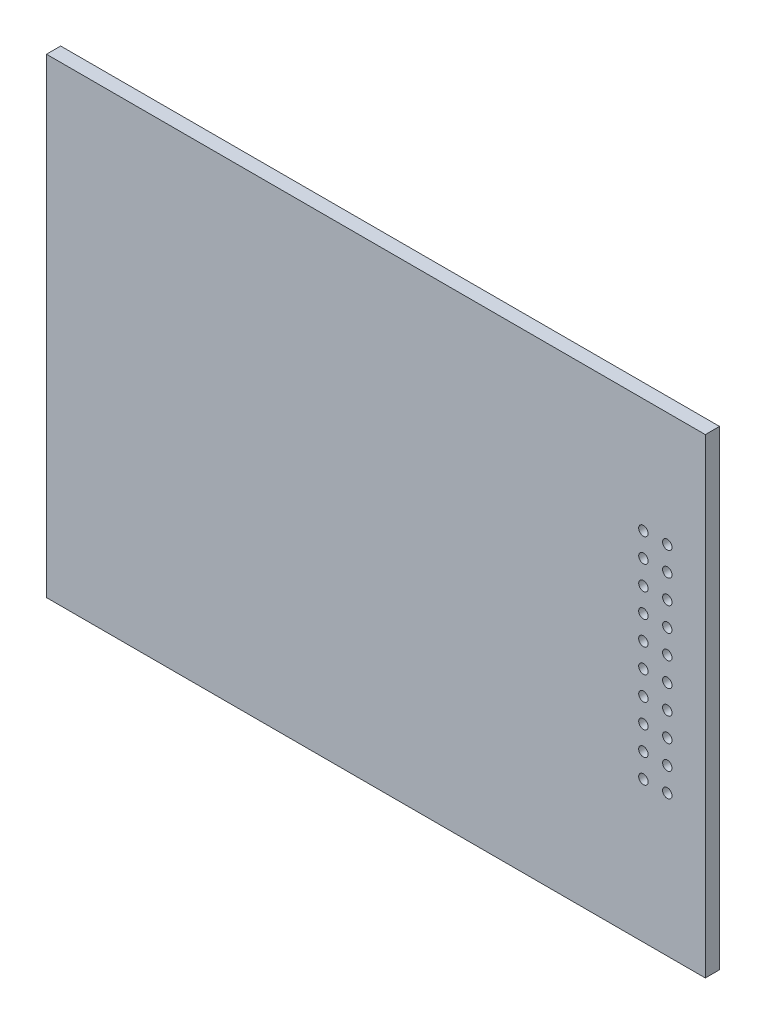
ISO-10303-21;
HEADER;
FILE_DESCRIPTION(('STEP AP214'),'2;1');
FILE_NAME('part.step','',(''),(''),'','','');
FILE_SCHEMA(('AUTOMOTIVE_DESIGN { 1 0 10303 214 1 1 1 1 }'));
ENDSEC;
DATA;
#1=APPLICATION_CONTEXT('core data for automotive mechanical design processes');
#2=APPLICATION_PROTOCOL_DEFINITION('international standard','automotive_design',2000,#1);
#3=PRODUCT_CONTEXT('',#1,'mechanical');
#4=PRODUCT('Part','Part','',(#3));
#5=PRODUCT_RELATED_PRODUCT_CATEGORY('part','',(#4));
#6=PRODUCT_DEFINITION_FORMATION('','',#4);
#7=PRODUCT_DEFINITION_CONTEXT('part definition',#1,'design');
#8=PRODUCT_DEFINITION('design','',#6,#7);
#9=PRODUCT_DEFINITION_SHAPE('','',#8);
#10=(LENGTH_UNIT() NAMED_UNIT(*) SI_UNIT(.MILLI.,.METRE.));
#11=(NAMED_UNIT(*) PLANE_ANGLE_UNIT() SI_UNIT($,.RADIAN.));
#12=(NAMED_UNIT(*) SI_UNIT($,.STERADIAN.) SOLID_ANGLE_UNIT());
#13=UNCERTAINTY_MEASURE_WITH_UNIT(LENGTH_MEASURE(1.E-05),#10,'distance_accuracy_value','');
#14=(GEOMETRIC_REPRESENTATION_CONTEXT(3) GLOBAL_UNCERTAINTY_ASSIGNED_CONTEXT((#13)) GLOBAL_UNIT_ASSIGNED_CONTEXT((#10,
#11,#12)) REPRESENTATION_CONTEXT('',''));
#15=CARTESIAN_POINT('',(0.,0.,0.));
#16=DIRECTION('',(0.,0.,1.));
#17=DIRECTION('',(1.,0.,0.));
#18=AXIS2_PLACEMENT_3D('',#15,#16,#17);
#19=CARTESIAN_POINT('',(85.96,-32.14,-0.046));
#20=DIRECTION('',(0.,0.,-1.));
#21=DIRECTION('',(0.,-1.,0.));
#22=AXIS2_PLACEMENT_3D('',#19,#20,#21);
#23=CYLINDRICAL_SURFACE('',#22,0.5);
#24=CARTESIAN_POINT('',(85.96,-32.14,0.));
#25=DIRECTION('',(0.,0.,-1.));
#26=DIRECTION('',(0.,-1.,0.));
#27=AXIS2_PLACEMENT_3D('',#24,#25,#26);
#28=CIRCLE('',#27,0.5);
#29=CARTESIAN_POINT('',(85.96,-32.64,0.));
#30=VERTEX_POINT('',#29);
#31=EDGE_CURVE('E395',#30,#30,#28,.T.);
#32=ORIENTED_EDGE('',*,*,#31,.T.);
#33=DIRECTION('',(0.,0.,1.));
#34=VECTOR('',#33,1.);
#35=CARTESIAN_POINT('',(85.96,-32.64,-0.046));
#36=LINE('',#35,#34);
#37=CARTESIAN_POINT('',(85.96,-32.64,1.51));
#38=VERTEX_POINT('',#37);
#39=EDGE_CURVE('E11',#30,#38,#36,.T.);
#40=ORIENTED_EDGE('',*,*,#39,.T.);
#41=CARTESIAN_POINT('',(85.96,-32.14,1.51));
#42=DIRECTION('',(0.,0.,-1.));
#43=DIRECTION('',(0.,-1.,0.));
#44=AXIS2_PLACEMENT_3D('',#41,#42,#43);
#45=CIRCLE('',#44,0.5);
#46=EDGE_CURVE('E345',#38,#38,#45,.T.);
#47=ORIENTED_EDGE('',*,*,#46,.F.);
#48=ORIENTED_EDGE('',*,*,#39,.F.);
#49=EDGE_LOOP('',(#32,#40,#47,#48));
#50=FACE_BOUND('',#49,.T.);
#51=ADVANCED_FACE('F17',(#50),#23,.F.);
#52=CARTESIAN_POINT('',(85.96,-34.68,-0.046));
#53=DIRECTION('',(0.,0.,-1.));
#54=DIRECTION('',(0.,-1.,0.));
#55=AXIS2_PLACEMENT_3D('',#52,#53,#54);
#56=CYLINDRICAL_SURFACE('',#55,0.5);
#57=CARTESIAN_POINT('',(85.96,-34.68,0.));
#58=DIRECTION('',(0.,0.,-1.));
#59=DIRECTION('',(0.,-1.,0.));
#60=AXIS2_PLACEMENT_3D('',#57,#58,#59);
#61=CIRCLE('',#60,0.5);
#62=CARTESIAN_POINT('',(85.96,-35.18,0.));
#63=VERTEX_POINT('',#62);
#64=EDGE_CURVE('E392',#63,#63,#61,.T.);
#65=ORIENTED_EDGE('',*,*,#64,.T.);
#66=DIRECTION('',(0.,0.,1.));
#67=VECTOR('',#66,1.);
#68=CARTESIAN_POINT('',(85.96,-35.18,-0.046));
#69=LINE('',#68,#67);
#70=CARTESIAN_POINT('',(85.96,-35.18,1.51));
#71=VERTEX_POINT('',#70);
#72=EDGE_CURVE('E20',#63,#71,#69,.T.);
#73=ORIENTED_EDGE('',*,*,#72,.T.);
#74=CARTESIAN_POINT('',(85.96,-34.68,1.51));
#75=DIRECTION('',(0.,0.,-1.));
#76=DIRECTION('',(0.,-1.,0.));
#77=AXIS2_PLACEMENT_3D('',#74,#75,#76);
#78=CIRCLE('',#77,0.5);
#79=EDGE_CURVE('E342',#71,#71,#78,.T.);
#80=ORIENTED_EDGE('',*,*,#79,.F.);
#81=ORIENTED_EDGE('',*,*,#72,.F.);
#82=EDGE_LOOP('',(#65,#73,#80,#81));
#83=FACE_BOUND('',#82,.T.);
#84=ADVANCED_FACE('F560',(#83),#56,.F.);
#85=CARTESIAN_POINT('',(85.96,-37.22,-0.046));
#86=DIRECTION('',(0.,0.,-1.));
#87=DIRECTION('',(0.,-1.,0.));
#88=AXIS2_PLACEMENT_3D('',#85,#86,#87);
#89=CYLINDRICAL_SURFACE('',#88,0.5);
#90=CARTESIAN_POINT('',(85.96,-37.22,0.));
#91=DIRECTION('',(0.,0.,-1.));
#92=DIRECTION('',(0.,-1.,0.));
#93=AXIS2_PLACEMENT_3D('',#90,#91,#92);
#94=CIRCLE('',#93,0.5);
#95=CARTESIAN_POINT('',(85.96,-37.72,0.));
#96=VERTEX_POINT('',#95);
#97=EDGE_CURVE('E385',#96,#96,#94,.T.);
#98=ORIENTED_EDGE('',*,*,#97,.T.);
#99=DIRECTION('',(0.,0.,1.));
#100=VECTOR('',#99,1.);
#101=CARTESIAN_POINT('',(85.96,-37.72,-0.046));
#102=LINE('',#101,#100);
#103=CARTESIAN_POINT('',(85.96,-37.72,1.51));
#104=VERTEX_POINT('',#103);
#105=EDGE_CURVE('E489',#96,#104,#102,.T.);
#106=ORIENTED_EDGE('',*,*,#105,.T.);
#107=CARTESIAN_POINT('',(85.96,-37.22,1.51));
#108=DIRECTION('',(0.,0.,-1.));
#109=DIRECTION('',(0.,-1.,0.));
#110=AXIS2_PLACEMENT_3D('',#107,#108,#109);
#111=CIRCLE('',#110,0.5);
#112=EDGE_CURVE('E346',#104,#104,#111,.T.);
#113=ORIENTED_EDGE('',*,*,#112,.F.);
#114=ORIENTED_EDGE('',*,*,#105,.F.);
#115=EDGE_LOOP('',(#98,#106,#113,#114));
#116=FACE_BOUND('',#115,.T.);
#117=ADVANCED_FACE('F564',(#116),#89,.F.);
#118=CARTESIAN_POINT('',(85.96,-39.76,-0.046));
#119=DIRECTION('',(0.,0.,-1.));
#120=DIRECTION('',(0.,-1.,0.));
#121=AXIS2_PLACEMENT_3D('',#118,#119,#120);
#122=CYLINDRICAL_SURFACE('',#121,0.5);
#123=CARTESIAN_POINT('',(85.96,-39.76,0.));
#124=DIRECTION('',(0.,0.,-1.));
#125=DIRECTION('',(0.,-1.,0.));
#126=AXIS2_PLACEMENT_3D('',#123,#124,#125);
#127=CIRCLE('',#126,0.5);
#128=CARTESIAN_POINT('',(85.96,-40.26,0.));
#129=VERTEX_POINT('',#128);
#130=EDGE_CURVE('E336',#129,#129,#127,.T.);
#131=ORIENTED_EDGE('',*,*,#130,.T.);
#132=DIRECTION('',(0.,0.,1.));
#133=VECTOR('',#132,1.);
#134=CARTESIAN_POINT('',(85.96,-40.26,-0.046));
#135=LINE('',#134,#133);
#136=CARTESIAN_POINT('',(85.96,-40.26,1.51));
#137=VERTEX_POINT('',#136);
#138=EDGE_CURVE('E492',#129,#137,#135,.T.);
#139=ORIENTED_EDGE('',*,*,#138,.T.);
#140=CARTESIAN_POINT('',(85.96,-39.76,1.51));
#141=DIRECTION('',(0.,0.,-1.));
#142=DIRECTION('',(0.,-1.,0.));
#143=AXIS2_PLACEMENT_3D('',#140,#141,#142);
#144=CIRCLE('',#143,0.5);
#145=EDGE_CURVE('E468',#137,#137,#144,.T.);
#146=ORIENTED_EDGE('',*,*,#145,.F.);
#147=ORIENTED_EDGE('',*,*,#138,.F.);
#148=EDGE_LOOP('',(#131,#139,#146,#147));
#149=FACE_BOUND('',#148,.T.);
#150=ADVANCED_FACE('F502',(#149),#122,.F.);
#151=CARTESIAN_POINT('',(85.96,-42.3,-0.046));
#152=DIRECTION('',(0.,0.,-1.));
#153=DIRECTION('',(0.,-1.,0.));
#154=AXIS2_PLACEMENT_3D('',#151,#152,#153);
#155=CYLINDRICAL_SURFACE('',#154,0.5);
#156=CARTESIAN_POINT('',(85.96,-42.3,0.));
#157=DIRECTION('',(0.,0.,-1.));
#158=DIRECTION('',(0.,-1.,0.));
#159=AXIS2_PLACEMENT_3D('',#156,#157,#158);
#160=CIRCLE('',#159,0.5);
#161=CARTESIAN_POINT('',(85.96,-42.8,0.));
#162=VERTEX_POINT('',#161);
#163=EDGE_CURVE('E332',#162,#162,#160,.T.);
#164=ORIENTED_EDGE('',*,*,#163,.T.);
#165=DIRECTION('',(0.,0.,1.));
#166=VECTOR('',#165,1.);
#167=CARTESIAN_POINT('',(85.96,-42.8,-0.046));
#168=LINE('',#167,#166);
#169=CARTESIAN_POINT('',(85.96,-42.8,1.51));
#170=VERTEX_POINT('',#169);
#171=EDGE_CURVE('E495',#162,#170,#168,.T.);
#172=ORIENTED_EDGE('',*,*,#171,.T.);
#173=CARTESIAN_POINT('',(85.96,-42.3,1.51));
#174=DIRECTION('',(0.,0.,-1.));
#175=DIRECTION('',(0.,-1.,0.));
#176=AXIS2_PLACEMENT_3D('',#173,#174,#175);
#177=CIRCLE('',#176,0.5);
#178=EDGE_CURVE('E464',#170,#170,#177,.T.);
#179=ORIENTED_EDGE('',*,*,#178,.F.);
#180=ORIENTED_EDGE('',*,*,#171,.F.);
#181=EDGE_LOOP('',(#164,#172,#179,#180));
#182=FACE_BOUND('',#181,.T.);
#183=ADVANCED_FACE('F659',(#182),#155,.F.);
#184=CARTESIAN_POINT('',(83.42,-32.14,-0.046));
#185=DIRECTION('',(0.,0.,-1.));
#186=DIRECTION('',(0.,-1.,0.));
#187=AXIS2_PLACEMENT_3D('',#184,#185,#186);
#188=CYLINDRICAL_SURFACE('',#187,0.5);
#189=CARTESIAN_POINT('',(83.42,-32.14,0.));
#190=DIRECTION('',(0.,0.,-1.));
#191=DIRECTION('',(0.,-1.,0.));
#192=AXIS2_PLACEMENT_3D('',#189,#190,#191);
#193=CIRCLE('',#192,0.5);
#194=CARTESIAN_POINT('',(83.42,-32.64,0.));
#195=VERTEX_POINT('',#194);
#196=EDGE_CURVE('E337',#195,#195,#193,.T.);
#197=ORIENTED_EDGE('',*,*,#196,.T.);
#198=DIRECTION('',(0.,0.,1.));
#199=VECTOR('',#198,1.);
#200=CARTESIAN_POINT('',(83.42,-32.64,-0.046));
#201=LINE('',#200,#199);
#202=CARTESIAN_POINT('',(83.42,-32.64,1.51));
#203=VERTEX_POINT('',#202);
#204=EDGE_CURVE('E331',#195,#203,#201,.T.);
#205=ORIENTED_EDGE('',*,*,#204,.T.);
#206=CARTESIAN_POINT('',(83.42,-32.14,1.51));
#207=DIRECTION('',(0.,0.,-1.));
#208=DIRECTION('',(0.,-1.,0.));
#209=AXIS2_PLACEMENT_3D('',#206,#207,#208);
#210=CIRCLE('',#209,0.5);
#211=EDGE_CURVE('E458',#203,#203,#210,.T.);
#212=ORIENTED_EDGE('',*,*,#211,.F.);
#213=ORIENTED_EDGE('',*,*,#204,.F.);
#214=EDGE_LOOP('',(#197,#205,#212,#213));
#215=FACE_BOUND('',#214,.T.);
#216=ADVANCED_FACE('F655',(#215),#188,.F.);
#217=CARTESIAN_POINT('',(83.42,-34.68,-0.046));
#218=DIRECTION('',(0.,0.,-1.));
#219=DIRECTION('',(0.,-1.,0.));
#220=AXIS2_PLACEMENT_3D('',#217,#218,#219);
#221=CYLINDRICAL_SURFACE('',#220,0.5);
#222=CARTESIAN_POINT('',(83.42,-34.68,0.));
#223=DIRECTION('',(0.,0.,-1.));
#224=DIRECTION('',(0.,-1.,0.));
#225=AXIS2_PLACEMENT_3D('',#222,#223,#224);
#226=CIRCLE('',#225,0.5);
#227=CARTESIAN_POINT('',(83.42,-35.18,0.));
#228=VERTEX_POINT('',#227);
#229=EDGE_CURVE('E375',#228,#228,#226,.T.);
#230=ORIENTED_EDGE('',*,*,#229,.T.);
#231=DIRECTION('',(0.,0.,1.));
#232=VECTOR('',#231,1.);
#233=CARTESIAN_POINT('',(83.42,-35.18,-0.046));
#234=LINE('',#233,#232);
#235=CARTESIAN_POINT('',(83.42,-35.18,1.51));
#236=VERTEX_POINT('',#235);
#237=EDGE_CURVE('E328',#228,#236,#234,.T.);
#238=ORIENTED_EDGE('',*,*,#237,.T.);
#239=CARTESIAN_POINT('',(83.42,-34.68,1.51));
#240=DIRECTION('',(0.,0.,-1.));
#241=DIRECTION('',(0.,-1.,0.));
#242=AXIS2_PLACEMENT_3D('',#239,#240,#241);
#243=CIRCLE('',#242,0.5);
#244=EDGE_CURVE('E454',#236,#236,#243,.T.);
#245=ORIENTED_EDGE('',*,*,#244,.F.);
#246=ORIENTED_EDGE('',*,*,#237,.F.);
#247=EDGE_LOOP('',(#230,#238,#245,#246));
#248=FACE_BOUND('',#247,.T.);
#249=ADVANCED_FACE('F651',(#248),#221,.F.);
#250=CARTESIAN_POINT('',(83.42,-37.22,-0.046));
#251=DIRECTION('',(0.,0.,-1.));
#252=DIRECTION('',(0.,-1.,0.));
#253=AXIS2_PLACEMENT_3D('',#250,#251,#252);
#254=CYLINDRICAL_SURFACE('',#253,0.5);
#255=CARTESIAN_POINT('',(83.42,-37.22,0.));
#256=DIRECTION('',(0.,0.,-1.));
#257=DIRECTION('',(0.,-1.,0.));
#258=AXIS2_PLACEMENT_3D('',#255,#256,#257);
#259=CIRCLE('',#258,0.5);
#260=CARTESIAN_POINT('',(83.42,-37.72,0.));
#261=VERTEX_POINT('',#260);
#262=EDGE_CURVE('E371',#261,#261,#259,.T.);
#263=ORIENTED_EDGE('',*,*,#262,.T.);
#264=DIRECTION('',(0.,0.,1.));
#265=VECTOR('',#264,1.);
#266=CARTESIAN_POINT('',(83.42,-37.72,-0.046));
#267=LINE('',#266,#265);
#268=CARTESIAN_POINT('',(83.42,-37.72,1.51));
#269=VERTEX_POINT('',#268);
#270=EDGE_CURVE('E287',#261,#269,#267,.T.);
#271=ORIENTED_EDGE('',*,*,#270,.T.);
#272=CARTESIAN_POINT('',(83.42,-37.22,1.51));
#273=DIRECTION('',(0.,0.,-1.));
#274=DIRECTION('',(0.,-1.,0.));
#275=AXIS2_PLACEMENT_3D('',#272,#273,#274);
#276=CIRCLE('',#275,0.5);
#277=EDGE_CURVE('E450',#269,#269,#276,.T.);
#278=ORIENTED_EDGE('',*,*,#277,.F.);
#279=ORIENTED_EDGE('',*,*,#270,.F.);
#280=EDGE_LOOP('',(#263,#271,#278,#279));
#281=FACE_BOUND('',#280,.T.);
#282=ADVANCED_FACE('F633',(#281),#254,.F.);
#283=CARTESIAN_POINT('',(83.42,-39.76,-0.046));
#284=DIRECTION('',(0.,0.,-1.));
#285=DIRECTION('',(0.,-1.,0.));
#286=AXIS2_PLACEMENT_3D('',#283,#284,#285);
#287=CYLINDRICAL_SURFACE('',#286,0.5);
#288=CARTESIAN_POINT('',(83.42,-39.76,0.));
#289=DIRECTION('',(0.,0.,-1.));
#290=DIRECTION('',(0.,-1.,0.));
#291=AXIS2_PLACEMENT_3D('',#288,#289,#290);
#292=CIRCLE('',#291,0.5);
#293=CARTESIAN_POINT('',(83.42,-40.26,0.));
#294=VERTEX_POINT('',#293);
#295=EDGE_CURVE('E364',#294,#294,#292,.T.);
#296=ORIENTED_EDGE('',*,*,#295,.T.);
#297=DIRECTION('',(0.,0.,1.));
#298=VECTOR('',#297,1.);
#299=CARTESIAN_POINT('',(83.42,-40.26,-0.046));
#300=LINE('',#299,#298);
#301=CARTESIAN_POINT('',(83.42,-40.26,1.51));
#302=VERTEX_POINT('',#301);
#303=EDGE_CURVE('E284',#294,#302,#300,.T.);
#304=ORIENTED_EDGE('',*,*,#303,.T.);
#305=CARTESIAN_POINT('',(83.42,-39.76,1.51));
#306=DIRECTION('',(0.,0.,-1.));
#307=DIRECTION('',(0.,-1.,0.));
#308=AXIS2_PLACEMENT_3D('',#305,#306,#307);
#309=CIRCLE('',#308,0.5);
#310=EDGE_CURVE('E446',#302,#302,#309,.T.);
#311=ORIENTED_EDGE('',*,*,#310,.F.);
#312=ORIENTED_EDGE('',*,*,#303,.F.);
#313=EDGE_LOOP('',(#296,#304,#311,#312));
#314=FACE_BOUND('',#313,.T.);
#315=ADVANCED_FACE('F629',(#314),#287,.F.);
#316=CARTESIAN_POINT('',(83.42,-42.3,-0.046));
#317=DIRECTION('',(0.,0.,-1.));
#318=DIRECTION('',(0.,-1.,0.));
#319=AXIS2_PLACEMENT_3D('',#316,#317,#318);
#320=CYLINDRICAL_SURFACE('',#319,0.5);
#321=CARTESIAN_POINT('',(83.42,-42.3,0.));
#322=DIRECTION('',(0.,0.,-1.));
#323=DIRECTION('',(0.,-1.,0.));
#324=AXIS2_PLACEMENT_3D('',#321,#322,#323);
#325=CIRCLE('',#324,0.5);
#326=CARTESIAN_POINT('',(83.42,-42.8,0.));
#327=VERTEX_POINT('',#326);
#328=EDGE_CURVE('E360',#327,#327,#325,.T.);
#329=ORIENTED_EDGE('',*,*,#328,.T.);
#330=DIRECTION('',(0.,0.,1.));
#331=VECTOR('',#330,1.);
#332=CARTESIAN_POINT('',(83.42,-42.8,-0.046));
#333=LINE('',#332,#331);
#334=CARTESIAN_POINT('',(83.42,-42.8,1.51));
#335=VERTEX_POINT('',#334);
#336=EDGE_CURVE('E288',#327,#335,#333,.T.);
#337=ORIENTED_EDGE('',*,*,#336,.T.);
#338=CARTESIAN_POINT('',(83.42,-42.3,1.51));
#339=DIRECTION('',(0.,0.,-1.));
#340=DIRECTION('',(0.,-1.,0.));
#341=AXIS2_PLACEMENT_3D('',#338,#339,#340);
#342=CIRCLE('',#341,0.5);
#343=EDGE_CURVE('E442',#335,#335,#342,.T.);
#344=ORIENTED_EDGE('',*,*,#343,.F.);
#345=ORIENTED_EDGE('',*,*,#336,.F.);
#346=EDGE_LOOP('',(#329,#337,#344,#345));
#347=FACE_BOUND('',#346,.T.);
#348=ADVANCED_FACE('F632',(#347),#320,.F.);
#349=CARTESIAN_POINT('',(85.96,-44.84,-0.046));
#350=DIRECTION('',(0.,0.,-1.));
#351=DIRECTION('',(0.,-1.,0.));
#352=AXIS2_PLACEMENT_3D('',#349,#350,#351);
#353=CYLINDRICAL_SURFACE('',#352,0.5);
#354=CARTESIAN_POINT('',(85.96,-44.84,0.));
#355=DIRECTION('',(0.,0.,-1.));
#356=DIRECTION('',(0.,-1.,0.));
#357=AXIS2_PLACEMENT_3D('',#354,#355,#356);
#358=CIRCLE('',#357,0.5);
#359=CARTESIAN_POINT('',(85.96,-45.34,0.));
#360=VERTEX_POINT('',#359);
#361=EDGE_CURVE('E354',#360,#360,#358,.T.);
#362=ORIENTED_EDGE('',*,*,#361,.T.);
#363=DIRECTION('',(0.,0.,1.));
#364=VECTOR('',#363,1.);
#365=CARTESIAN_POINT('',(85.96,-45.34,-0.046));
#366=LINE('',#365,#364);
#367=CARTESIAN_POINT('',(85.96,-45.34,1.51));
#368=VERTEX_POINT('',#367);
#369=EDGE_CURVE('E388',#360,#368,#366,.T.);
#370=ORIENTED_EDGE('',*,*,#369,.T.);
#371=CARTESIAN_POINT('',(85.96,-44.84,1.51));
#372=DIRECTION('',(0.,0.,-1.));
#373=DIRECTION('',(0.,-1.,0.));
#374=AXIS2_PLACEMENT_3D('',#371,#372,#373);
#375=CIRCLE('',#374,0.5);
#376=EDGE_CURVE('E438',#368,#368,#375,.T.);
#377=ORIENTED_EDGE('',*,*,#376,.F.);
#378=ORIENTED_EDGE('',*,*,#369,.F.);
#379=EDGE_LOOP('',(#362,#370,#377,#378));
#380=FACE_BOUND('',#379,.T.);
#381=ADVANCED_FACE('F644',(#380),#353,.F.);
#382=CARTESIAN_POINT('',(85.96,-47.38,-0.046));
#383=DIRECTION('',(0.,0.,-1.));
#384=DIRECTION('',(0.,-1.,0.));
#385=AXIS2_PLACEMENT_3D('',#382,#383,#384);
#386=CYLINDRICAL_SURFACE('',#385,0.5);
#387=CARTESIAN_POINT('',(85.96,-47.38,0.));
#388=DIRECTION('',(0.,0.,-1.));
#389=DIRECTION('',(0.,-1.,0.));
#390=AXIS2_PLACEMENT_3D('',#387,#388,#389);
#391=CIRCLE('',#390,0.5);
#392=CARTESIAN_POINT('',(85.96,-47.88,0.));
#393=VERTEX_POINT('',#392);
#394=EDGE_CURVE('E350',#393,#393,#391,.T.);
#395=ORIENTED_EDGE('',*,*,#394,.T.);
#396=DIRECTION('',(0.,0.,1.));
#397=VECTOR('',#396,1.);
#398=CARTESIAN_POINT('',(85.96,-47.88,-0.046));
#399=LINE('',#398,#397);
#400=CARTESIAN_POINT('',(85.96,-47.88,1.51));
#401=VERTEX_POINT('',#400);
#402=EDGE_CURVE('E412',#393,#401,#399,.T.);
#403=ORIENTED_EDGE('',*,*,#402,.T.);
#404=CARTESIAN_POINT('',(85.96,-47.38,1.51));
#405=DIRECTION('',(0.,0.,-1.));
#406=DIRECTION('',(0.,-1.,0.));
#407=AXIS2_PLACEMENT_3D('',#404,#405,#406);
#408=CIRCLE('',#407,0.5);
#409=EDGE_CURVE('E434',#401,#401,#408,.T.);
#410=ORIENTED_EDGE('',*,*,#409,.F.);
#411=ORIENTED_EDGE('',*,*,#402,.F.);
#412=EDGE_LOOP('',(#395,#403,#410,#411));
#413=FACE_BOUND('',#412,.T.);
#414=ADVANCED_FACE('F640',(#413),#386,.F.);
#415=CARTESIAN_POINT('',(85.96,-49.92,-0.046));
#416=DIRECTION('',(0.,0.,-1.));
#417=DIRECTION('',(0.,-1.,0.));
#418=AXIS2_PLACEMENT_3D('',#415,#416,#417);
#419=CYLINDRICAL_SURFACE('',#418,0.5);
#420=CARTESIAN_POINT('',(85.96,-49.92,0.));
#421=DIRECTION('',(0.,0.,-1.));
#422=DIRECTION('',(0.,-1.,0.));
#423=AXIS2_PLACEMENT_3D('',#420,#421,#422);
#424=CIRCLE('',#423,0.5);
#425=CARTESIAN_POINT('',(85.96,-50.42,0.));
#426=VERTEX_POINT('',#425);
#427=EDGE_CURVE('E341',#426,#426,#424,.T.);
#428=ORIENTED_EDGE('',*,*,#427,.T.);
#429=DIRECTION('',(0.,0.,1.));
#430=VECTOR('',#429,1.);
#431=CARTESIAN_POINT('',(85.96,-50.42,-0.046));
#432=LINE('',#431,#430);
#433=CARTESIAN_POINT('',(85.96,-50.42,1.51));
#434=VERTEX_POINT('',#433);
#435=EDGE_CURVE('E409',#426,#434,#432,.T.);
#436=ORIENTED_EDGE('',*,*,#435,.T.);
#437=CARTESIAN_POINT('',(85.96,-49.92,1.51));
#438=DIRECTION('',(0.,0.,-1.));
#439=DIRECTION('',(0.,-1.,0.));
#440=AXIS2_PLACEMENT_3D('',#437,#438,#439);
#441=CIRCLE('',#440,0.5);
#442=EDGE_CURVE('E430',#434,#434,#441,.T.);
#443=ORIENTED_EDGE('',*,*,#442,.F.);
#444=ORIENTED_EDGE('',*,*,#435,.F.);
#445=EDGE_LOOP('',(#428,#436,#443,#444));
#446=FACE_BOUND('',#445,.T.);
#447=ADVANCED_FACE('F627',(#446),#419,.F.);
#448=CARTESIAN_POINT('',(85.96,-52.46,-0.046));
#449=DIRECTION('',(0.,0.,-1.));
#450=DIRECTION('',(0.,-1.,0.));
#451=AXIS2_PLACEMENT_3D('',#448,#449,#450);
#452=CYLINDRICAL_SURFACE('',#451,0.5);
#453=CARTESIAN_POINT('',(85.96,-52.46,0.));
#454=DIRECTION('',(0.,0.,-1.));
#455=DIRECTION('',(0.,-1.,0.));
#456=AXIS2_PLACEMENT_3D('',#453,#454,#455);
#457=CIRCLE('',#456,0.5);
#458=CARTESIAN_POINT('',(85.96,-52.96,0.));
#459=VERTEX_POINT('',#458);
#460=EDGE_CURVE('E327',#459,#459,#457,.T.);
#461=ORIENTED_EDGE('',*,*,#460,.T.);
#462=DIRECTION('',(0.,0.,1.));
#463=VECTOR('',#462,1.);
#464=CARTESIAN_POINT('',(85.96,-52.96,-0.046));
#465=LINE('',#464,#463);
#466=CARTESIAN_POINT('',(85.96,-52.96,1.51));
#467=VERTEX_POINT('',#466);
#468=EDGE_CURVE('E358',#459,#467,#465,.T.);
#469=ORIENTED_EDGE('',*,*,#468,.T.);
#470=CARTESIAN_POINT('',(85.96,-52.46,1.51));
#471=DIRECTION('',(0.,0.,-1.));
#472=DIRECTION('',(0.,-1.,0.));
#473=AXIS2_PLACEMENT_3D('',#470,#471,#472);
#474=CIRCLE('',#473,0.5);
#475=EDGE_CURVE('E420',#467,#467,#474,.T.);
#476=ORIENTED_EDGE('',*,*,#475,.F.);
#477=ORIENTED_EDGE('',*,*,#468,.F.);
#478=EDGE_LOOP('',(#461,#469,#476,#477));
#479=FACE_BOUND('',#478,.T.);
#480=ADVANCED_FACE('F623',(#479),#452,.F.);
#481=CARTESIAN_POINT('',(85.96,-55.,-0.046));
#482=DIRECTION('',(0.,0.,-1.));
#483=DIRECTION('',(0.,-1.,0.));
#484=AXIS2_PLACEMENT_3D('',#481,#482,#483);
#485=CYLINDRICAL_SURFACE('',#484,0.5);
#486=CARTESIAN_POINT('',(85.96,-55.,0.));
#487=DIRECTION('',(0.,0.,-1.));
#488=DIRECTION('',(0.,-1.,0.));
#489=AXIS2_PLACEMENT_3D('',#486,#487,#488);
#490=CIRCLE('',#489,0.5);
#491=CARTESIAN_POINT('',(85.96,-55.5,0.));
#492=VERTEX_POINT('',#491);
#493=EDGE_CURVE('E323',#492,#492,#490,.T.);
#494=ORIENTED_EDGE('',*,*,#493,.T.);
#495=DIRECTION('',(0.,0.,1.));
#496=VECTOR('',#495,1.);
#497=CARTESIAN_POINT('',(85.96,-55.5,-0.046));
#498=LINE('',#497,#496);
#499=CARTESIAN_POINT('',(85.96,-55.5,1.51));
#500=VERTEX_POINT('',#499);
#501=EDGE_CURVE('E355',#492,#500,#498,.T.);
#502=ORIENTED_EDGE('',*,*,#501,.T.);
#503=CARTESIAN_POINT('',(85.96,-55.,1.51));
#504=DIRECTION('',(0.,0.,-1.));
#505=DIRECTION('',(0.,-1.,0.));
#506=AXIS2_PLACEMENT_3D('',#503,#504,#505);
#507=CIRCLE('',#506,0.5);
#508=EDGE_CURVE('E280',#500,#500,#507,.T.);
#509=ORIENTED_EDGE('',*,*,#508,.F.);
#510=ORIENTED_EDGE('',*,*,#501,.F.);
#511=EDGE_LOOP('',(#494,#502,#509,#510));
#512=FACE_BOUND('',#511,.T.);
#513=ADVANCED_FACE('F620',(#512),#485,.F.);
#514=CARTESIAN_POINT('',(83.42,-44.84,-0.046));
#515=DIRECTION('',(0.,0.,-1.));
#516=DIRECTION('',(0.,-1.,0.));
#517=AXIS2_PLACEMENT_3D('',#514,#515,#516);
#518=CYLINDRICAL_SURFACE('',#517,0.5);
#519=CARTESIAN_POINT('',(83.42,-44.84,0.));
#520=DIRECTION('',(0.,0.,-1.));
#521=DIRECTION('',(0.,-1.,0.));
#522=AXIS2_PLACEMENT_3D('',#519,#520,#521);
#523=CIRCLE('',#522,0.5);
#524=CARTESIAN_POINT('',(83.42,-45.34,0.));
#525=VERTEX_POINT('',#524);
#526=EDGE_CURVE('E319',#525,#525,#523,.T.);
#527=ORIENTED_EDGE('',*,*,#526,.T.);
#528=DIRECTION('',(0.,0.,1.));
#529=VECTOR('',#528,1.);
#530=CARTESIAN_POINT('',(83.42,-45.34,-0.046));
#531=LINE('',#530,#529);
#532=CARTESIAN_POINT('',(83.42,-45.34,1.51));
#533=VERTEX_POINT('',#532);
#534=EDGE_CURVE('E359',#525,#533,#531,.T.);
#535=ORIENTED_EDGE('',*,*,#534,.T.);
#536=CARTESIAN_POINT('',(83.42,-44.84,1.51));
#537=DIRECTION('',(0.,0.,-1.));
#538=DIRECTION('',(0.,-1.,0.));
#539=AXIS2_PLACEMENT_3D('',#536,#537,#538);
#540=CIRCLE('',#539,0.5);
#541=EDGE_CURVE('E276',#533,#533,#540,.T.);
#542=ORIENTED_EDGE('',*,*,#541,.F.);
#543=ORIENTED_EDGE('',*,*,#534,.F.);
#544=EDGE_LOOP('',(#527,#535,#542,#543));
#545=FACE_BOUND('',#544,.T.);
#546=ADVANCED_FACE('F618',(#545),#518,.F.);
#547=CARTESIAN_POINT('',(83.42,-47.38,-0.046));
#548=DIRECTION('',(0.,0.,-1.));
#549=DIRECTION('',(0.,-1.,0.));
#550=AXIS2_PLACEMENT_3D('',#547,#548,#549);
#551=CYLINDRICAL_SURFACE('',#550,0.5);
#552=CARTESIAN_POINT('',(83.42,-47.38,0.));
#553=DIRECTION('',(0.,0.,-1.));
#554=DIRECTION('',(0.,-1.,0.));
#555=AXIS2_PLACEMENT_3D('',#552,#553,#554);
#556=CIRCLE('',#555,0.5);
#557=CARTESIAN_POINT('',(83.42,-47.88,0.));
#558=VERTEX_POINT('',#557);
#559=EDGE_CURVE('E312',#558,#558,#556,.T.);
#560=ORIENTED_EDGE('',*,*,#559,.T.);
#561=DIRECTION('',(0.,0.,1.));
#562=VECTOR('',#561,1.);
#563=CARTESIAN_POINT('',(83.42,-47.88,-0.046));
#564=LINE('',#563,#562);
#565=CARTESIAN_POINT('',(83.42,-47.88,1.51));
#566=VERTEX_POINT('',#565);
#567=EDGE_CURVE('E273',#558,#566,#564,.T.);
#568=ORIENTED_EDGE('',*,*,#567,.T.);
#569=CARTESIAN_POINT('',(83.42,-47.38,1.51));
#570=DIRECTION('',(0.,0.,-1.));
#571=DIRECTION('',(0.,-1.,0.));
#572=AXIS2_PLACEMENT_3D('',#569,#570,#571);
#573=CIRCLE('',#572,0.5);
#574=EDGE_CURVE('E281',#566,#566,#573,.T.);
#575=ORIENTED_EDGE('',*,*,#574,.F.);
#576=ORIENTED_EDGE('',*,*,#567,.F.);
#577=EDGE_LOOP('',(#560,#568,#575,#576));
#578=FACE_BOUND('',#577,.T.);
#579=ADVANCED_FACE('F612',(#578),#551,.F.);
#580=CARTESIAN_POINT('',(83.42,-49.92,-0.046));
#581=DIRECTION('',(0.,0.,-1.));
#582=DIRECTION('',(0.,-1.,0.));
#583=AXIS2_PLACEMENT_3D('',#580,#581,#582);
#584=CYLINDRICAL_SURFACE('',#583,0.5);
#585=CARTESIAN_POINT('',(83.42,-49.92,0.));
#586=DIRECTION('',(0.,0.,-1.));
#587=DIRECTION('',(0.,-1.,0.));
#588=AXIS2_PLACEMENT_3D('',#585,#586,#587);
#589=CIRCLE('',#588,0.5);
#590=CARTESIAN_POINT('',(83.42,-50.42,0.));
#591=VERTEX_POINT('',#590);
#592=EDGE_CURVE('E308',#591,#591,#589,.T.);
#593=ORIENTED_EDGE('',*,*,#592,.T.);
#594=DIRECTION('',(0.,0.,1.));
#595=VECTOR('',#594,1.);
#596=CARTESIAN_POINT('',(83.42,-50.42,-0.046));
#597=LINE('',#596,#595);
#598=CARTESIAN_POINT('',(83.42,-50.42,1.51));
#599=VERTEX_POINT('',#598);
#600=EDGE_CURVE('E271',#591,#599,#597,.T.);
#601=ORIENTED_EDGE('',*,*,#600,.T.);
#602=CARTESIAN_POINT('',(83.42,-49.92,1.51));
#603=DIRECTION('',(0.,0.,-1.));
#604=DIRECTION('',(0.,-1.,0.));
#605=AXIS2_PLACEMENT_3D('',#602,#603,#604);
#606=CIRCLE('',#605,0.5);
#607=EDGE_CURVE('E416',#599,#599,#606,.T.);
#608=ORIENTED_EDGE('',*,*,#607,.F.);
#609=ORIENTED_EDGE('',*,*,#600,.F.);
#610=EDGE_LOOP('',(#593,#601,#608,#609));
#611=FACE_BOUND('',#610,.T.);
#612=ADVANCED_FACE('F608',(#611),#584,.F.);
#613=CARTESIAN_POINT('',(83.42,-52.46,-0.046));
#614=DIRECTION('',(0.,0.,-1.));
#615=DIRECTION('',(0.,-1.,0.));
#616=AXIS2_PLACEMENT_3D('',#613,#614,#615);
#617=CYLINDRICAL_SURFACE('',#616,0.5);
#618=CARTESIAN_POINT('',(83.42,-52.46,0.));
#619=DIRECTION('',(0.,0.,-1.));
#620=DIRECTION('',(0.,-1.,0.));
#621=AXIS2_PLACEMENT_3D('',#618,#619,#620);
#622=CIRCLE('',#621,0.5);
#623=CARTESIAN_POINT('',(83.42,-52.96,0.));
#624=VERTEX_POINT('',#623);
#625=EDGE_CURVE('E302',#624,#624,#622,.T.);
#626=ORIENTED_EDGE('',*,*,#625,.T.);
#627=DIRECTION('',(0.,0.,1.));
#628=VECTOR('',#627,1.);
#629=CARTESIAN_POINT('',(83.42,-52.96,-0.046));
#630=LINE('',#629,#628);
#631=CARTESIAN_POINT('',(83.42,-52.96,1.51));
#632=VERTEX_POINT('',#631);
#633=EDGE_CURVE('E274',#624,#632,#630,.T.);
#634=ORIENTED_EDGE('',*,*,#633,.T.);
#635=CARTESIAN_POINT('',(83.42,-52.46,1.51));
#636=DIRECTION('',(0.,0.,-1.));
#637=DIRECTION('',(0.,-1.,0.));
#638=AXIS2_PLACEMENT_3D('',#635,#636,#637);
#639=CIRCLE('',#638,0.5);
#640=EDGE_CURVE('E407',#632,#632,#639,.T.);
#641=ORIENTED_EDGE('',*,*,#640,.F.);
#642=ORIENTED_EDGE('',*,*,#633,.F.);
#643=EDGE_LOOP('',(#626,#634,#641,#642));
#644=FACE_BOUND('',#643,.T.);
#645=ADVANCED_FACE('F554',(#644),#617,.F.);
#646=CARTESIAN_POINT('',(83.42,-55.,-0.046));
#647=DIRECTION('',(0.,0.,-1.));
#648=DIRECTION('',(0.,-1.,0.));
#649=AXIS2_PLACEMENT_3D('',#646,#647,#648);
#650=CYLINDRICAL_SURFACE('',#649,0.5);
#651=CARTESIAN_POINT('',(83.42,-55.,0.));
#652=DIRECTION('',(0.,0.,-1.));
#653=DIRECTION('',(0.,-1.,0.));
#654=AXIS2_PLACEMENT_3D('',#651,#652,#653);
#655=CIRCLE('',#654,0.5);
#656=CARTESIAN_POINT('',(83.42,-55.5,0.));
#657=VERTEX_POINT('',#656);
#658=EDGE_CURVE('E298',#657,#657,#655,.T.);
#659=ORIENTED_EDGE('',*,*,#658,.T.);
#660=DIRECTION('',(0.,0.,1.));
#661=VECTOR('',#660,1.);
#662=CARTESIAN_POINT('',(83.42,-55.5,-0.046));
#663=LINE('',#662,#661);
#664=CARTESIAN_POINT('',(83.42,-55.5,1.51));
#665=VERTEX_POINT('',#664);
#666=EDGE_CURVE('E396',#657,#665,#663,.T.);
#667=ORIENTED_EDGE('',*,*,#666,.T.);
#668=CARTESIAN_POINT('',(83.42,-55.,1.51));
#669=DIRECTION('',(0.,0.,-1.));
#670=DIRECTION('',(0.,-1.,0.));
#671=AXIS2_PLACEMENT_3D('',#668,#669,#670);
#672=CIRCLE('',#671,0.5);
#673=EDGE_CURVE('E404',#665,#665,#672,.T.);
#674=ORIENTED_EDGE('',*,*,#673,.F.);
#675=ORIENTED_EDGE('',*,*,#666,.F.);
#676=EDGE_LOOP('',(#659,#667,#674,#675));
#677=FACE_BOUND('',#676,.T.);
#678=ADVANCED_FACE('F548',(#677),#650,.F.);
#679=CARTESIAN_POINT('',(20.,-20.,0.));
#680=DIRECTION('',(0.,1.,0.));
#681=DIRECTION('',(1.,0.,0.));
#682=AXIS2_PLACEMENT_3D('',#679,#680,#681);
#683=PLANE('',#682);
#684=DIRECTION('',(0.,0.,1.));
#685=VECTOR('',#684,1.);
#686=CARTESIAN_POINT('',(20.,-20.,0.));
#687=LINE('',#686,#685);
#688=CARTESIAN_POINT('',(20.,-20.,0.));
#689=VERTEX_POINT('',#688);
#690=CARTESIAN_POINT('',(20.,-20.,1.51));
#691=VERTEX_POINT('',#690);
#692=EDGE_CURVE('E289',#689,#691,#687,.T.);
#693=ORIENTED_EDGE('',*,*,#692,.T.);
#694=DIRECTION('',(1.,0.,0.));
#695=VECTOR('',#694,1.);
#696=CARTESIAN_POINT('',(20.,-20.,1.51));
#697=LINE('',#696,#695);
#698=CARTESIAN_POINT('',(90.,-20.,1.51));
#699=VERTEX_POINT('',#698);
#700=EDGE_CURVE('E401',#691,#699,#697,.T.);
#701=ORIENTED_EDGE('',*,*,#700,.T.);
#702=DIRECTION('',(0.,0.,1.));
#703=VECTOR('',#702,1.);
#704=CARTESIAN_POINT('',(90.,-20.,0.));
#705=LINE('',#704,#703);
#706=CARTESIAN_POINT('',(90.,-20.,0.));
#707=VERTEX_POINT('',#706);
#708=EDGE_CURVE('E255',#707,#699,#705,.T.);
#709=ORIENTED_EDGE('',*,*,#708,.F.);
#710=DIRECTION('',(1.,0.,0.));
#711=VECTOR('',#710,1.);
#712=CARTESIAN_POINT('',(20.,-20.,0.));
#713=LINE('',#712,#711);
#714=EDGE_CURVE('E238',#689,#707,#713,.T.);
#715=ORIENTED_EDGE('',*,*,#714,.F.);
#716=EDGE_LOOP('',(#693,#701,#709,#715));
#717=FACE_BOUND('',#716,.T.);
#718=ADVANCED_FACE('F508',(#717),#683,.T.);
#719=CARTESIAN_POINT('',(0.,0.,1.51));
#720=DIRECTION('',(0.,0.,1.));
#721=DIRECTION('',(1.,0.,0.));
#722=AXIS2_PLACEMENT_3D('',#719,#720,#721);
#723=PLANE('',#722);
#724=ORIENTED_EDGE('',*,*,#46,.T.);
#725=EDGE_LOOP('',(#724));
#726=FACE_BOUND('',#725,.T.);
#727=ORIENTED_EDGE('',*,*,#79,.T.);
#728=EDGE_LOOP('',(#727));
#729=FACE_BOUND('',#728,.T.);
#730=ORIENTED_EDGE('',*,*,#112,.T.);
#731=EDGE_LOOP('',(#730));
#732=FACE_BOUND('',#731,.T.);
#733=ORIENTED_EDGE('',*,*,#145,.T.);
#734=EDGE_LOOP('',(#733));
#735=FACE_BOUND('',#734,.T.);
#736=ORIENTED_EDGE('',*,*,#178,.T.);
#737=EDGE_LOOP('',(#736));
#738=FACE_BOUND('',#737,.T.);
#739=ORIENTED_EDGE('',*,*,#211,.T.);
#740=EDGE_LOOP('',(#739));
#741=FACE_BOUND('',#740,.T.);
#742=ORIENTED_EDGE('',*,*,#244,.T.);
#743=EDGE_LOOP('',(#742));
#744=FACE_BOUND('',#743,.T.);
#745=ORIENTED_EDGE('',*,*,#277,.T.);
#746=EDGE_LOOP('',(#745));
#747=FACE_BOUND('',#746,.T.);
#748=ORIENTED_EDGE('',*,*,#310,.T.);
#749=EDGE_LOOP('',(#748));
#750=FACE_BOUND('',#749,.T.);
#751=ORIENTED_EDGE('',*,*,#343,.T.);
#752=EDGE_LOOP('',(#751));
#753=FACE_BOUND('',#752,.T.);
#754=ORIENTED_EDGE('',*,*,#376,.T.);
#755=EDGE_LOOP('',(#754));
#756=FACE_BOUND('',#755,.T.);
#757=ORIENTED_EDGE('',*,*,#409,.T.);
#758=EDGE_LOOP('',(#757));
#759=FACE_BOUND('',#758,.T.);
#760=ORIENTED_EDGE('',*,*,#442,.T.);
#761=EDGE_LOOP('',(#760));
#762=FACE_BOUND('',#761,.T.);
#763=ORIENTED_EDGE('',*,*,#475,.T.);
#764=EDGE_LOOP('',(#763));
#765=FACE_BOUND('',#764,.T.);
#766=ORIENTED_EDGE('',*,*,#508,.T.);
#767=EDGE_LOOP('',(#766));
#768=FACE_BOUND('',#767,.T.);
#769=ORIENTED_EDGE('',*,*,#541,.T.);
#770=EDGE_LOOP('',(#769));
#771=FACE_BOUND('',#770,.T.);
#772=ORIENTED_EDGE('',*,*,#574,.T.);
#773=EDGE_LOOP('',(#772));
#774=FACE_BOUND('',#773,.T.);
#775=ORIENTED_EDGE('',*,*,#607,.T.);
#776=EDGE_LOOP('',(#775));
#777=FACE_BOUND('',#776,.T.);
#778=ORIENTED_EDGE('',*,*,#640,.T.);
#779=EDGE_LOOP('',(#778));
#780=FACE_BOUND('',#779,.T.);
#781=ORIENTED_EDGE('',*,*,#673,.T.);
#782=EDGE_LOOP('',(#781));
#783=FACE_BOUND('',#782,.T.);
#784=DIRECTION('',(-1.,0.,0.));
#785=VECTOR('',#784,1.);
#786=CARTESIAN_POINT('',(90.,-70.,1.51));
#787=LINE('',#786,#785);
#788=CARTESIAN_POINT('',(90.,-70.,1.51));
#789=VERTEX_POINT('',#788);
#790=CARTESIAN_POINT('',(20.,-70.,1.51));
#791=VERTEX_POINT('',#790);
#792=EDGE_CURVE('E261',#789,#791,#787,.T.);
#793=ORIENTED_EDGE('',*,*,#792,.F.);
#794=DIRECTION('',(0.,-1.,0.));
#795=VECTOR('',#794,1.);
#796=CARTESIAN_POINT('',(90.,-20.,1.51));
#797=LINE('',#796,#795);
#798=EDGE_CURVE('E245',#699,#789,#797,.T.);
#799=ORIENTED_EDGE('',*,*,#798,.F.);
#800=ORIENTED_EDGE('',*,*,#700,.F.);
#801=DIRECTION('',(0.,1.,0.));
#802=VECTOR('',#801,1.);
#803=CARTESIAN_POINT('',(20.,-70.,1.51));
#804=LINE('',#803,#802);
#805=EDGE_CURVE('E244',#791,#691,#804,.T.);
#806=ORIENTED_EDGE('',*,*,#805,.F.);
#807=EDGE_LOOP('',(#793,#799,#800,#806));
#808=FACE_BOUND('',#807,.T.);
#809=ADVANCED_FACE('F505',(#726,#729,#732,#735,#738,#741,#744,#747,#750,#753,#756,#759,#762,
#765,#768,#771,#774,#777,#780,#783,#808),#723,.T.);
#810=CARTESIAN_POINT('',(0.,0.,0.));
#811=DIRECTION('',(0.,0.,1.));
#812=DIRECTION('',(1.,0.,0.));
#813=AXIS2_PLACEMENT_3D('',#810,#811,#812);
#814=PLANE('',#813);
#815=ORIENTED_EDGE('',*,*,#31,.F.);
#816=EDGE_LOOP('',(#815));
#817=FACE_BOUND('',#816,.T.);
#818=ORIENTED_EDGE('',*,*,#64,.F.);
#819=EDGE_LOOP('',(#818));
#820=FACE_BOUND('',#819,.T.);
#821=ORIENTED_EDGE('',*,*,#97,.F.);
#822=EDGE_LOOP('',(#821));
#823=FACE_BOUND('',#822,.T.);
#824=ORIENTED_EDGE('',*,*,#130,.F.);
#825=EDGE_LOOP('',(#824));
#826=FACE_BOUND('',#825,.T.);
#827=ORIENTED_EDGE('',*,*,#163,.F.);
#828=EDGE_LOOP('',(#827));
#829=FACE_BOUND('',#828,.T.);
#830=ORIENTED_EDGE('',*,*,#196,.F.);
#831=EDGE_LOOP('',(#830));
#832=FACE_BOUND('',#831,.T.);
#833=ORIENTED_EDGE('',*,*,#229,.F.);
#834=EDGE_LOOP('',(#833));
#835=FACE_BOUND('',#834,.T.);
#836=ORIENTED_EDGE('',*,*,#262,.F.);
#837=EDGE_LOOP('',(#836));
#838=FACE_BOUND('',#837,.T.);
#839=ORIENTED_EDGE('',*,*,#295,.F.);
#840=EDGE_LOOP('',(#839));
#841=FACE_BOUND('',#840,.T.);
#842=ORIENTED_EDGE('',*,*,#328,.F.);
#843=EDGE_LOOP('',(#842));
#844=FACE_BOUND('',#843,.T.);
#845=ORIENTED_EDGE('',*,*,#361,.F.);
#846=EDGE_LOOP('',(#845));
#847=FACE_BOUND('',#846,.T.);
#848=ORIENTED_EDGE('',*,*,#394,.F.);
#849=EDGE_LOOP('',(#848));
#850=FACE_BOUND('',#849,.T.);
#851=ORIENTED_EDGE('',*,*,#427,.F.);
#852=EDGE_LOOP('',(#851));
#853=FACE_BOUND('',#852,.T.);
#854=ORIENTED_EDGE('',*,*,#460,.F.);
#855=EDGE_LOOP('',(#854));
#856=FACE_BOUND('',#855,.T.);
#857=ORIENTED_EDGE('',*,*,#493,.F.);
#858=EDGE_LOOP('',(#857));
#859=FACE_BOUND('',#858,.T.);
#860=ORIENTED_EDGE('',*,*,#526,.F.);
#861=EDGE_LOOP('',(#860));
#862=FACE_BOUND('',#861,.T.);
#863=ORIENTED_EDGE('',*,*,#559,.F.);
#864=EDGE_LOOP('',(#863));
#865=FACE_BOUND('',#864,.T.);
#866=ORIENTED_EDGE('',*,*,#592,.F.);
#867=EDGE_LOOP('',(#866));
#868=FACE_BOUND('',#867,.T.);
#869=ORIENTED_EDGE('',*,*,#625,.F.);
#870=EDGE_LOOP('',(#869));
#871=FACE_BOUND('',#870,.T.);
#872=ORIENTED_EDGE('',*,*,#658,.F.);
#873=EDGE_LOOP('',(#872));
#874=FACE_BOUND('',#873,.T.);
#875=DIRECTION('',(0.,1.,0.));
#876=VECTOR('',#875,1.);
#877=CARTESIAN_POINT('',(20.,-70.,0.));
#878=LINE('',#877,#876);
#879=CARTESIAN_POINT('',(20.,-70.,0.));
#880=VERTEX_POINT('',#879);
#881=EDGE_CURVE('E293',#880,#689,#878,.T.);
#882=ORIENTED_EDGE('',*,*,#881,.T.);
#883=ORIENTED_EDGE('',*,*,#714,.T.);
#884=DIRECTION('',(0.,-1.,0.));
#885=VECTOR('',#884,1.);
#886=CARTESIAN_POINT('',(90.,-20.,0.));
#887=LINE('',#886,#885);
#888=CARTESIAN_POINT('',(90.,-70.,0.));
#889=VERTEX_POINT('',#888);
#890=EDGE_CURVE('E232',#707,#889,#887,.T.);
#891=ORIENTED_EDGE('',*,*,#890,.T.);
#892=DIRECTION('',(-1.,0.,0.));
#893=VECTOR('',#892,1.);
#894=CARTESIAN_POINT('',(90.,-70.,0.));
#895=LINE('',#894,#893);
#896=EDGE_CURVE('E236',#889,#880,#895,.T.);
#897=ORIENTED_EDGE('',*,*,#896,.T.);
#898=EDGE_LOOP('',(#882,#883,#891,#897));
#899=FACE_BOUND('',#898,.T.);
#900=ADVANCED_FACE('F235',(#817,#820,#823,#826,#829,#832,#835,#838,#841,#844,#847,#850,#853,
#856,#859,#862,#865,#868,#871,#874,#899),#814,.F.);
#901=CARTESIAN_POINT('',(20.,-70.,0.));
#902=DIRECTION('',(-1.,0.,0.));
#903=DIRECTION('',(0.,0.,1.));
#904=AXIS2_PLACEMENT_3D('',#901,#902,#903);
#905=PLANE('',#904);
#906=DIRECTION('',(0.,0.,1.));
#907=VECTOR('',#906,1.);
#908=CARTESIAN_POINT('',(20.,-70.,0.));
#909=LINE('',#908,#907);
#910=EDGE_CURVE('E253',#880,#791,#909,.T.);
#911=ORIENTED_EDGE('',*,*,#910,.T.);
#912=ORIENTED_EDGE('',*,*,#805,.T.);
#913=ORIENTED_EDGE('',*,*,#692,.F.);
#914=ORIENTED_EDGE('',*,*,#881,.F.);
#915=EDGE_LOOP('',(#911,#912,#913,#914));
#916=FACE_BOUND('',#915,.T.);
#917=ADVANCED_FACE('F545',(#916),#905,.T.);
#918=CARTESIAN_POINT('',(90.,-20.,0.));
#919=DIRECTION('',(1.,0.,0.));
#920=DIRECTION('',(0.,1.,0.));
#921=AXIS2_PLACEMENT_3D('',#918,#919,#920);
#922=PLANE('',#921);
#923=ORIENTED_EDGE('',*,*,#708,.T.);
#924=ORIENTED_EDGE('',*,*,#798,.T.);
#925=DIRECTION('',(0.,0.,1.));
#926=VECTOR('',#925,1.);
#927=CARTESIAN_POINT('',(90.,-70.,0.));
#928=LINE('',#927,#926);
#929=EDGE_CURVE('E251',#889,#789,#928,.T.);
#930=ORIENTED_EDGE('',*,*,#929,.F.);
#931=ORIENTED_EDGE('',*,*,#890,.F.);
#932=EDGE_LOOP('',(#923,#924,#930,#931));
#933=FACE_BOUND('',#932,.T.);
#934=ADVANCED_FACE('F257',(#933),#922,.T.);
#935=CARTESIAN_POINT('',(90.,-70.,0.));
#936=DIRECTION('',(0.,-1.,0.));
#937=DIRECTION('',(0.,0.,-1.));
#938=AXIS2_PLACEMENT_3D('',#935,#936,#937);
#939=PLANE('',#938);
#940=ORIENTED_EDGE('',*,*,#929,.T.);
#941=ORIENTED_EDGE('',*,*,#792,.T.);
#942=ORIENTED_EDGE('',*,*,#910,.F.);
#943=ORIENTED_EDGE('',*,*,#896,.F.);
#944=EDGE_LOOP('',(#940,#941,#942,#943));
#945=FACE_BOUND('',#944,.T.);
#946=ADVANCED_FACE('F249',(#945),#939,.T.);
#947=CLOSED_SHELL('',(#51,#84,#117,#150,#183,#216,#249,#282,#315,#348,#381,#414,#447,#480,#513,
#546,#579,#612,#645,#678,#718,#809,#900,#917,#934,#946));
#948=MANIFOLD_SOLID_BREP('B1',#947);
#949=ADVANCED_BREP_SHAPE_REPRESENTATION('',(#18,#948),#14);
#950=SHAPE_DEFINITION_REPRESENTATION(#9,#949);
ENDSEC;
END-ISO-10303-21;
